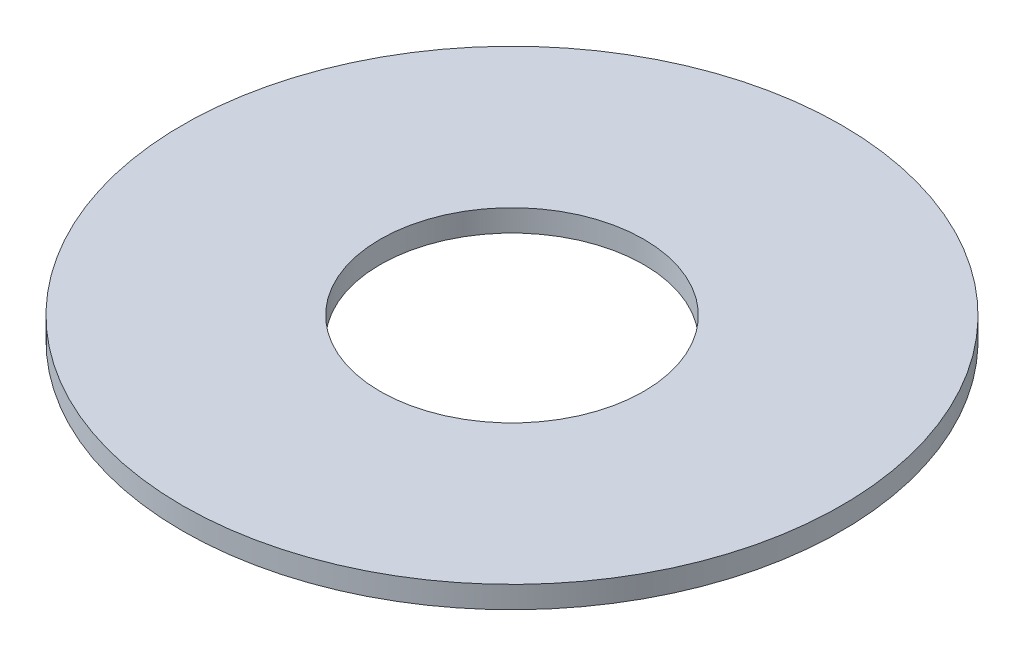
ISO-10303-21;
HEADER;
FILE_DESCRIPTION(('STEP AP214'),'2;1');
FILE_NAME('part.step','',(''),(''),'','','');
FILE_SCHEMA(('AUTOMOTIVE_DESIGN { 1 0 10303 214 1 1 1 1 }'));
ENDSEC;
DATA;
#1=APPLICATION_CONTEXT('core data for automotive mechanical design processes');
#2=APPLICATION_PROTOCOL_DEFINITION('international standard','automotive_design',2000,#1);
#3=PRODUCT_CONTEXT('',#1,'mechanical');
#4=PRODUCT('Part','Part','',(#3));
#5=PRODUCT_RELATED_PRODUCT_CATEGORY('part','',(#4));
#6=PRODUCT_DEFINITION_FORMATION('','',#4);
#7=PRODUCT_DEFINITION_CONTEXT('part definition',#1,'design');
#8=PRODUCT_DEFINITION('design','',#6,#7);
#9=PRODUCT_DEFINITION_SHAPE('','',#8);
#10=(LENGTH_UNIT() NAMED_UNIT(*) SI_UNIT(.MILLI.,.METRE.));
#11=(NAMED_UNIT(*) PLANE_ANGLE_UNIT() SI_UNIT($,.RADIAN.));
#12=(NAMED_UNIT(*) SI_UNIT($,.STERADIAN.) SOLID_ANGLE_UNIT());
#13=UNCERTAINTY_MEASURE_WITH_UNIT(LENGTH_MEASURE(1.E-05),#10,'distance_accuracy_value','');
#14=(GEOMETRIC_REPRESENTATION_CONTEXT(3) GLOBAL_UNCERTAINTY_ASSIGNED_CONTEXT((#13)) GLOBAL_UNIT_ASSIGNED_CONTEXT((#10,
#11,#12)) REPRESENTATION_CONTEXT('',''));
#15=CARTESIAN_POINT('',(0.,0.,0.));
#16=DIRECTION('',(0.,0.,1.));
#17=DIRECTION('',(1.,0.,0.));
#18=AXIS2_PLACEMENT_3D('',#15,#16,#17);
#19=CARTESIAN_POINT('',(0.,0.5,0.));
#20=DIRECTION('',(0.,1.,0.));
#21=DIRECTION('',(0.,0.,1.));
#22=AXIS2_PLACEMENT_3D('',#19,#20,#21);
#23=PLANE('',#22);
#24=CARTESIAN_POINT('',(0.,0.5,0.));
#25=DIRECTION('',(0.,1.,0.));
#26=DIRECTION('',(0.,0.,1.));
#27=AXIS2_PLACEMENT_3D('',#24,#25,#26);
#28=CIRCLE('',#27,7.5);
#29=CARTESIAN_POINT('',(0.,0.5,7.5));
#30=VERTEX_POINT('',#29);
#31=EDGE_CURVE('E10',#30,#30,#28,.T.);
#32=ORIENTED_EDGE('',*,*,#31,.T.);
#33=EDGE_LOOP('',(#32));
#34=FACE_BOUND('',#33,.T.);
#35=CARTESIAN_POINT('',(0.,0.5,0.));
#36=DIRECTION('',(0.,1.,0.));
#37=DIRECTION('',(0.,0.,1.));
#38=AXIS2_PLACEMENT_3D('',#35,#36,#37);
#39=CIRCLE('',#38,3.);
#40=CARTESIAN_POINT('',(0.,0.5,3.));
#41=VERTEX_POINT('',#40);
#42=EDGE_CURVE('E43',#41,#41,#39,.T.);
#43=ORIENTED_EDGE('',*,*,#42,.F.);
#44=EDGE_LOOP('',(#43));
#45=FACE_BOUND('',#44,.T.);
#46=ADVANCED_FACE('F32',(#34,#45),#23,.T.);
#47=CARTESIAN_POINT('',(0.,0.,0.));
#48=DIRECTION('',(0.,1.,0.));
#49=DIRECTION('',(0.,0.,1.));
#50=AXIS2_PLACEMENT_3D('',#47,#48,#49);
#51=PLANE('',#50);
#52=CARTESIAN_POINT('',(0.,0.,0.));
#53=DIRECTION('',(0.,1.,0.));
#54=DIRECTION('',(0.,0.,1.));
#55=AXIS2_PLACEMENT_3D('',#52,#53,#54);
#56=CIRCLE('',#55,7.5);
#57=CARTESIAN_POINT('',(0.,0.,7.5));
#58=VERTEX_POINT('',#57);
#59=EDGE_CURVE('E36',#58,#58,#56,.T.);
#60=ORIENTED_EDGE('',*,*,#59,.F.);
#61=EDGE_LOOP('',(#60));
#62=FACE_BOUND('',#61,.T.);
#63=CARTESIAN_POINT('',(0.,0.,0.));
#64=DIRECTION('',(0.,1.,0.));
#65=DIRECTION('',(0.,0.,1.));
#66=AXIS2_PLACEMENT_3D('',#63,#64,#65);
#67=CIRCLE('',#66,3.);
#68=CARTESIAN_POINT('',(0.,0.,3.));
#69=VERTEX_POINT('',#68);
#70=EDGE_CURVE('E45',#69,#69,#67,.T.);
#71=ORIENTED_EDGE('',*,*,#70,.T.);
#72=EDGE_LOOP('',(#71));
#73=FACE_BOUND('',#72,.T.);
#74=ADVANCED_FACE('F55',(#62,#73),#51,.F.);
#75=CARTESIAN_POINT('',(0.,0.5,0.));
#76=DIRECTION('',(0.,-1.,0.));
#77=DIRECTION('',(0.,0.,-1.));
#78=AXIS2_PLACEMENT_3D('',#75,#76,#77);
#79=CYLINDRICAL_SURFACE('',#78,7.5);
#80=ORIENTED_EDGE('',*,*,#31,.F.);
#81=EDGE_LOOP('',(#80));
#82=FACE_BOUND('',#81,.T.);
#83=ORIENTED_EDGE('',*,*,#59,.T.);
#84=EDGE_LOOP('',(#83));
#85=FACE_BOUND('',#84,.T.);
#86=ADVANCED_FACE('F34',(#82,#85),#79,.T.);
#87=CARTESIAN_POINT('',(0.,0.5,0.));
#88=DIRECTION('',(0.,-1.,0.));
#89=DIRECTION('',(0.,0.,-1.));
#90=AXIS2_PLACEMENT_3D('',#87,#88,#89);
#91=CYLINDRICAL_SURFACE('',#90,3.);
#92=ORIENTED_EDGE('',*,*,#42,.T.);
#93=EDGE_LOOP('',(#92));
#94=FACE_BOUND('',#93,.T.);
#95=ORIENTED_EDGE('',*,*,#70,.F.);
#96=EDGE_LOOP('',(#95));
#97=FACE_BOUND('',#96,.T.);
#98=ADVANCED_FACE('F51',(#94,#97),#91,.F.);
#99=CLOSED_SHELL('',(#46,#74,#86,#98));
#100=MANIFOLD_SOLID_BREP('B2',#99);
#101=ADVANCED_BREP_SHAPE_REPRESENTATION('',(#18,#100),#14);
#102=SHAPE_DEFINITION_REPRESENTATION(#9,#101);
ENDSEC;
END-ISO-10303-21;
